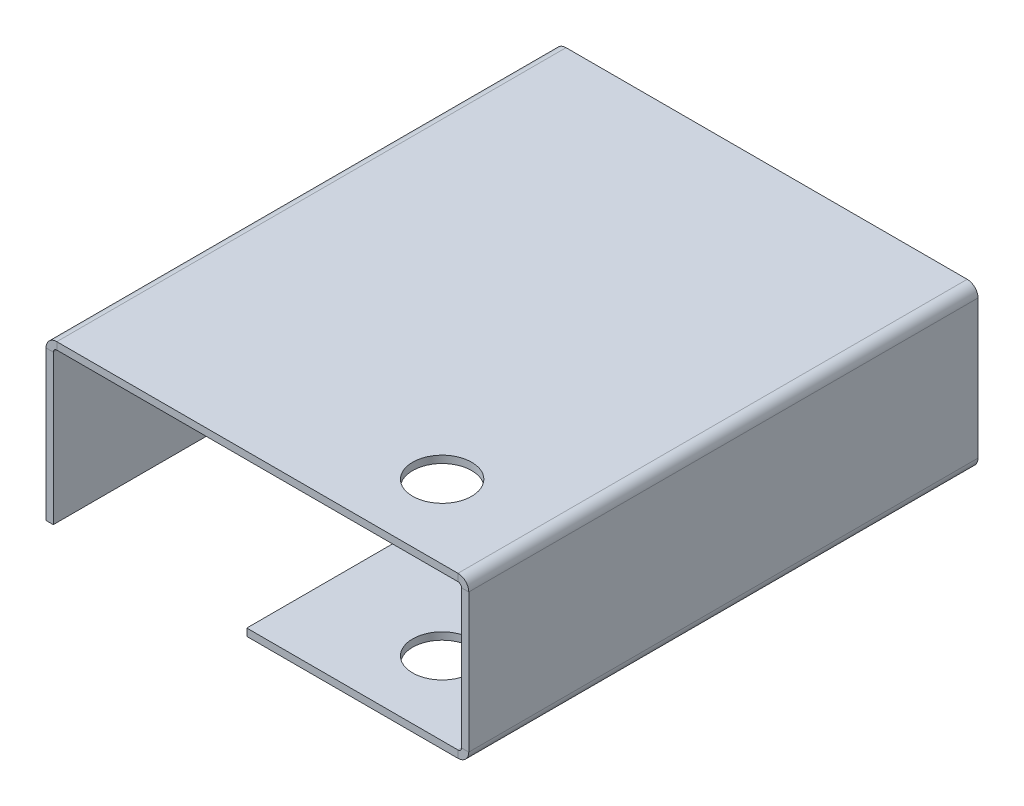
ISO-10303-21;
HEADER;
FILE_DESCRIPTION(('STEP AP214'),'2;1');
FILE_NAME('part.step','',(''),(''),'','','');
FILE_SCHEMA(('AUTOMOTIVE_DESIGN { 1 0 10303 214 1 1 1 1 }'));
ENDSEC;
DATA;
#1=APPLICATION_CONTEXT('core data for automotive mechanical design processes');
#2=APPLICATION_PROTOCOL_DEFINITION('international standard','automotive_design',2000,#1);
#3=PRODUCT_CONTEXT('',#1,'mechanical');
#4=PRODUCT('Part','Part','',(#3));
#5=PRODUCT_RELATED_PRODUCT_CATEGORY('part','',(#4));
#6=PRODUCT_DEFINITION_FORMATION('','',#4);
#7=PRODUCT_DEFINITION_CONTEXT('part definition',#1,'design');
#8=PRODUCT_DEFINITION('design','',#6,#7);
#9=PRODUCT_DEFINITION_SHAPE('','',#8);
#10=(LENGTH_UNIT() NAMED_UNIT(*) SI_UNIT(.MILLI.,.METRE.));
#11=(NAMED_UNIT(*) PLANE_ANGLE_UNIT() SI_UNIT($,.RADIAN.));
#12=(NAMED_UNIT(*) SI_UNIT($,.STERADIAN.) SOLID_ANGLE_UNIT());
#13=UNCERTAINTY_MEASURE_WITH_UNIT(LENGTH_MEASURE(1.E-05),#10,'distance_accuracy_value','');
#14=(GEOMETRIC_REPRESENTATION_CONTEXT(3) GLOBAL_UNCERTAINTY_ASSIGNED_CONTEXT((#13)) GLOBAL_UNIT_ASSIGNED_CONTEXT((#10,
#11,#12)) REPRESENTATION_CONTEXT('',''));
#15=CARTESIAN_POINT('',(0.,0.,0.));
#16=DIRECTION('',(0.,0.,1.));
#17=DIRECTION('',(1.,0.,0.));
#18=AXIS2_PLACEMENT_3D('',#15,#16,#17);
#19=CARTESIAN_POINT('',(-16.5539812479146,33.5756145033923,106.68));
#20=DIRECTION('',(0.,0.,1.));
#21=DIRECTION('',(1.,0.,0.));
#22=AXIS2_PLACEMENT_3D('',#19,#20,#21);
#23=PLANE('',#22);
#24=DIRECTION('',(0.,-1.,0.));
#25=VECTOR('',#24,1.);
#26=CARTESIAN_POINT('',(-16.5539812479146,33.5756145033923,106.68));
#27=LINE('',#26,#25);
#28=CARTESIAN_POINT('',(-16.5539812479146,33.5756145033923,106.68));
#29=VERTEX_POINT('',#28);
#30=CARTESIAN_POINT('',(-16.5539812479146,32.0516145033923,106.68));
#31=VERTEX_POINT('',#30);
#32=EDGE_CURVE('E11',#29,#31,#27,.T.);
#33=ORIENTED_EDGE('',*,*,#32,.F.);
#34=CARTESIAN_POINT('',(-16.5539812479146,31.3150145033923,106.68));
#35=DIRECTION('',(0.,0.,1.));
#36=DIRECTION('',(1.,0.,0.));
#37=AXIS2_PLACEMENT_3D('',#34,#35,#36);
#38=CIRCLE('',#37,2.2606);
#39=CARTESIAN_POINT('',(-18.8145812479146,31.3150145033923,106.68));
#40=VERTEX_POINT('',#39);
#41=EDGE_CURVE('E242',#40,#29,#38,.F.);
#42=ORIENTED_EDGE('',*,*,#41,.F.);
#43=DIRECTION('',(-1.,0.,0.));
#44=VECTOR('',#43,1.);
#45=CARTESIAN_POINT('',(-17.2905812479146,31.3150145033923,106.68));
#46=LINE('',#45,#44);
#47=CARTESIAN_POINT('',(-17.2905812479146,31.3150145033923,106.68));
#48=VERTEX_POINT('',#47);
#49=EDGE_CURVE('E51',#48,#40,#46,.T.);
#50=ORIENTED_EDGE('',*,*,#49,.F.);
#51=CARTESIAN_POINT('',(-16.5539812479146,31.3150145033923,106.68));
#52=DIRECTION('',(0.,0.,1.));
#53=DIRECTION('',(1.,0.,0.));
#54=AXIS2_PLACEMENT_3D('',#51,#52,#53);
#55=CIRCLE('',#54,0.7366);
#56=EDGE_CURVE('E254',#48,#31,#55,.F.);
#57=ORIENTED_EDGE('',*,*,#56,.T.);
#58=EDGE_LOOP('',(#33,#42,#50,#57));
#59=FACE_BOUND('',#58,.T.);
#60=ADVANCED_FACE('F43',(#59),#23,.T.);
#61=CARTESIAN_POINT('',(-17.2905812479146,31.3150145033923,106.68));
#62=DIRECTION('',(0.,0.,1.));
#63=DIRECTION('',(1.,0.,0.));
#64=AXIS2_PLACEMENT_3D('',#61,#62,#63);
#65=PLANE('',#64);
#66=DIRECTION('',(1.,0.,0.));
#67=VECTOR('',#66,1.);
#68=CARTESIAN_POINT('',(-18.8145812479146,33.5756145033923,106.68));
#69=LINE('',#68,#67);
#70=CARTESIAN_POINT('',(67.4910182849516,33.5756145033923,106.68));
#71=VERTEX_POINT('',#70);
#72=EDGE_CURVE('E239',#29,#71,#69,.T.);
#73=ORIENTED_EDGE('',*,*,#72,.F.);
#74=ORIENTED_EDGE('',*,*,#32,.T.);
#75=DIRECTION('',(1.,0.,0.));
#76=VECTOR('',#75,1.);
#77=CARTESIAN_POINT('',(-18.8145812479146,32.0516145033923,106.68));
#78=LINE('',#77,#76);
#79=CARTESIAN_POINT('',(67.4910182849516,32.0516145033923,106.68));
#80=VERTEX_POINT('',#79);
#81=EDGE_CURVE('E257',#31,#80,#78,.T.);
#82=ORIENTED_EDGE('',*,*,#81,.T.);
#83=DIRECTION('',(0.,1.,0.));
#84=VECTOR('',#83,1.);
#85=CARTESIAN_POINT('',(67.4910182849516,32.0516145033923,106.68));
#86=LINE('',#85,#84);
#87=EDGE_CURVE('E315',#80,#71,#86,.T.);
#88=ORIENTED_EDGE('',*,*,#87,.T.);
#89=EDGE_LOOP('',(#73,#74,#82,#88));
#90=FACE_BOUND('',#89,.T.);
#91=ADVANCED_FACE('F358',(#90),#65,.T.);
#92=CARTESIAN_POINT('',(-18.8145812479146,31.3150145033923,0.));
#93=DIRECTION('',(0.,0.,-1.));
#94=DIRECTION('',(-1.,0.,0.));
#95=AXIS2_PLACEMENT_3D('',#92,#93,#94);
#96=PLANE('',#95);
#97=DIRECTION('',(1.,0.,0.));
#98=VECTOR('',#97,1.);
#99=CARTESIAN_POINT('',(-18.8145812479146,31.3150145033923,0.));
#100=LINE('',#99,#98);
#101=CARTESIAN_POINT('',(-18.8145812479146,31.3150145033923,0.));
#102=VERTEX_POINT('',#101);
#103=CARTESIAN_POINT('',(-17.2905812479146,31.3150145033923,0.));
#104=VERTEX_POINT('',#103);
#105=EDGE_CURVE('E321',#102,#104,#100,.T.);
#106=ORIENTED_EDGE('',*,*,#105,.F.);
#107=CARTESIAN_POINT('',(-16.5539812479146,31.3150145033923,0.));
#108=DIRECTION('',(0.,0.,1.));
#109=DIRECTION('',(1.,0.,0.));
#110=AXIS2_PLACEMENT_3D('',#107,#108,#109);
#111=CIRCLE('',#110,2.2606);
#112=CARTESIAN_POINT('',(-16.5539812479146,33.5756145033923,0.));
#113=VERTEX_POINT('',#112);
#114=EDGE_CURVE('E197',#102,#113,#111,.F.);
#115=ORIENTED_EDGE('',*,*,#114,.T.);
#116=DIRECTION('',(0.,1.,0.));
#117=VECTOR('',#116,1.);
#118=CARTESIAN_POINT('',(-16.5539812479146,32.0516145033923,0.));
#119=LINE('',#118,#117);
#120=CARTESIAN_POINT('',(-16.5539812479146,32.0516145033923,0.));
#121=VERTEX_POINT('',#120);
#122=EDGE_CURVE('E319',#121,#113,#119,.T.);
#123=ORIENTED_EDGE('',*,*,#122,.F.);
#124=CARTESIAN_POINT('',(-16.5539812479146,31.3150145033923,0.));
#125=DIRECTION('',(0.,0.,1.));
#126=DIRECTION('',(1.,0.,0.));
#127=AXIS2_PLACEMENT_3D('',#124,#125,#126);
#128=CIRCLE('',#127,0.7366);
#129=EDGE_CURVE('E209',#104,#121,#128,.F.);
#130=ORIENTED_EDGE('',*,*,#129,.F.);
#131=EDGE_LOOP('',(#106,#115,#123,#130));
#132=FACE_BOUND('',#131,.T.);
#133=ADVANCED_FACE('F366',(#132),#96,.T.);
#134=CARTESIAN_POINT('',(-16.5539812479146,32.0516145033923,0.));
#135=DIRECTION('',(0.,0.,-1.));
#136=DIRECTION('',(-1.,0.,0.));
#137=AXIS2_PLACEMENT_3D('',#134,#135,#136);
#138=PLANE('',#137);
#139=DIRECTION('',(0.,1.,0.));
#140=VECTOR('',#139,1.);
#141=CARTESIAN_POINT('',(-18.8145812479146,0.,0.));
#142=LINE('',#141,#140);
#143=CARTESIAN_POINT('',(-18.8145812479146,0.,0.));
#144=VERTEX_POINT('',#143);
#145=EDGE_CURVE('E200',#144,#102,#142,.T.);
#146=ORIENTED_EDGE('',*,*,#145,.T.);
#147=ORIENTED_EDGE('',*,*,#105,.T.);
#148=DIRECTION('',(0.,1.,0.));
#149=VECTOR('',#148,1.);
#150=CARTESIAN_POINT('',(-17.2905812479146,0.,0.));
#151=LINE('',#150,#149);
#152=CARTESIAN_POINT('',(-17.2905812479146,0.,0.));
#153=VERTEX_POINT('',#152);
#154=EDGE_CURVE('E206',#153,#104,#151,.T.);
#155=ORIENTED_EDGE('',*,*,#154,.F.);
#156=DIRECTION('',(-1.,0.,0.));
#157=VECTOR('',#156,1.);
#158=CARTESIAN_POINT('',(-17.2905812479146,0.,0.));
#159=LINE('',#158,#157);
#160=EDGE_CURVE('E203',#153,#144,#159,.T.);
#161=ORIENTED_EDGE('',*,*,#160,.T.);
#162=EDGE_LOOP('',(#146,#147,#155,#161));
#163=FACE_BOUND('',#162,.T.);
#164=ADVANCED_FACE('F368',(#163),#138,.T.);
#165=CARTESIAN_POINT('',(69.7516182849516,31.3150145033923,106.68));
#166=DIRECTION('',(0.,0.,1.));
#167=DIRECTION('',(1.,0.,0.));
#168=AXIS2_PLACEMENT_3D('',#165,#166,#167);
#169=PLANE('',#168);
#170=DIRECTION('',(-1.,0.,0.));
#171=VECTOR('',#170,1.);
#172=CARTESIAN_POINT('',(69.7516182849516,31.3150145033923,106.68));
#173=LINE('',#172,#171);
#174=CARTESIAN_POINT('',(69.7516182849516,31.3150145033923,106.68));
#175=VERTEX_POINT('',#174);
#176=CARTESIAN_POINT('',(68.2276182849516,31.3150145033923,106.68));
#177=VERTEX_POINT('',#176);
#178=EDGE_CURVE('E317',#175,#177,#173,.T.);
#179=ORIENTED_EDGE('',*,*,#178,.F.);
#180=CARTESIAN_POINT('',(67.4910182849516,31.3150145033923,106.68));
#181=DIRECTION('',(0.,0.,1.));
#182=DIRECTION('',(1.,0.,0.));
#183=AXIS2_PLACEMENT_3D('',#180,#181,#182);
#184=CIRCLE('',#183,2.2606);
#185=EDGE_CURVE('E236',#71,#175,#184,.F.);
#186=ORIENTED_EDGE('',*,*,#185,.F.);
#187=ORIENTED_EDGE('',*,*,#87,.F.);
#188=CARTESIAN_POINT('',(67.4910182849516,31.3150145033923,106.68));
#189=DIRECTION('',(0.,0.,1.));
#190=DIRECTION('',(1.,0.,0.));
#191=AXIS2_PLACEMENT_3D('',#188,#189,#190);
#192=CIRCLE('',#191,0.7366);
#193=EDGE_CURVE('E260',#80,#177,#192,.F.);
#194=ORIENTED_EDGE('',*,*,#193,.T.);
#195=EDGE_LOOP('',(#179,#186,#187,#194));
#196=FACE_BOUND('',#195,.T.);
#197=ADVANCED_FACE('F370',(#196),#169,.T.);
#198=CARTESIAN_POINT('',(67.4910182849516,32.0516145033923,106.68));
#199=DIRECTION('',(0.,0.,1.));
#200=DIRECTION('',(1.,0.,0.));
#201=AXIS2_PLACEMENT_3D('',#198,#199,#200);
#202=PLANE('',#201);
#203=DIRECTION('',(0.,-1.,0.));
#204=VECTOR('',#203,1.);
#205=CARTESIAN_POINT('',(69.7516182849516,33.5756145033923,106.68));
#206=LINE('',#205,#204);
#207=CARTESIAN_POINT('',(69.7516182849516,2.2606,106.68));
#208=VERTEX_POINT('',#207);
#209=EDGE_CURVE('E233',#175,#208,#206,.T.);
#210=ORIENTED_EDGE('',*,*,#209,.F.);
#211=ORIENTED_EDGE('',*,*,#178,.T.);
#212=DIRECTION('',(0.,1.,0.));
#213=VECTOR('',#212,1.);
#214=CARTESIAN_POINT('',(68.2276182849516,33.5756145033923,106.68));
#215=LINE('',#214,#213);
#216=CARTESIAN_POINT('',(68.2276182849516,2.2606,106.68));
#217=VERTEX_POINT('',#216);
#218=EDGE_CURVE('E263',#177,#217,#215,.F.);
#219=ORIENTED_EDGE('',*,*,#218,.T.);
#220=DIRECTION('',(1.,0.,0.));
#221=VECTOR('',#220,1.);
#222=CARTESIAN_POINT('',(68.2276182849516,2.2606,106.68));
#223=LINE('',#222,#221);
#224=EDGE_CURVE('E65',#217,#208,#223,.T.);
#225=ORIENTED_EDGE('',*,*,#224,.T.);
#226=EDGE_LOOP('',(#210,#211,#219,#225));
#227=FACE_BOUND('',#226,.T.);
#228=ADVANCED_FACE('F376',(#227),#202,.T.);
#229=CARTESIAN_POINT('',(67.4910182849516,33.5756145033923,0.));
#230=DIRECTION('',(0.,0.,-1.));
#231=DIRECTION('',(-1.,0.,0.));
#232=AXIS2_PLACEMENT_3D('',#229,#230,#231);
#233=PLANE('',#232);
#234=DIRECTION('',(0.,-1.,0.));
#235=VECTOR('',#234,1.);
#236=CARTESIAN_POINT('',(67.4910182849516,33.5756145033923,0.));
#237=LINE('',#236,#235);
#238=CARTESIAN_POINT('',(67.4910182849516,33.5756145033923,0.));
#239=VERTEX_POINT('',#238);
#240=CARTESIAN_POINT('',(67.4910182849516,32.0516145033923,0.));
#241=VERTEX_POINT('',#240);
#242=EDGE_CURVE('E313',#239,#241,#237,.T.);
#243=ORIENTED_EDGE('',*,*,#242,.F.);
#244=CARTESIAN_POINT('',(67.4910182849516,31.3150145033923,0.));
#245=DIRECTION('',(0.,0.,1.));
#246=DIRECTION('',(1.,0.,0.));
#247=AXIS2_PLACEMENT_3D('',#244,#245,#246);
#248=CIRCLE('',#247,2.2606);
#249=CARTESIAN_POINT('',(69.7516182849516,31.3150145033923,0.));
#250=VERTEX_POINT('',#249);
#251=EDGE_CURVE('E191',#239,#250,#248,.F.);
#252=ORIENTED_EDGE('',*,*,#251,.T.);
#253=DIRECTION('',(1.,0.,0.));
#254=VECTOR('',#253,1.);
#255=CARTESIAN_POINT('',(68.2276182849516,31.3150145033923,0.));
#256=LINE('',#255,#254);
#257=CARTESIAN_POINT('',(68.2276182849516,31.3150145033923,0.));
#258=VERTEX_POINT('',#257);
#259=EDGE_CURVE('E311',#258,#250,#256,.T.);
#260=ORIENTED_EDGE('',*,*,#259,.F.);
#261=CARTESIAN_POINT('',(67.4910182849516,31.3150145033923,0.));
#262=DIRECTION('',(0.,0.,1.));
#263=DIRECTION('',(1.,0.,0.));
#264=AXIS2_PLACEMENT_3D('',#261,#262,#263);
#265=CIRCLE('',#264,0.7366);
#266=EDGE_CURVE('E215',#241,#258,#265,.F.);
#267=ORIENTED_EDGE('',*,*,#266,.F.);
#268=EDGE_LOOP('',(#243,#252,#260,#267));
#269=FACE_BOUND('',#268,.T.);
#270=ADVANCED_FACE('F415',(#269),#233,.T.);
#271=CARTESIAN_POINT('',(68.2276182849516,31.3150145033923,0.));
#272=DIRECTION('',(0.,0.,-1.));
#273=DIRECTION('',(-1.,0.,0.));
#274=AXIS2_PLACEMENT_3D('',#271,#272,#273);
#275=PLANE('',#274);
#276=DIRECTION('',(1.,0.,0.));
#277=VECTOR('',#276,1.);
#278=CARTESIAN_POINT('',(-18.8145812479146,33.5756145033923,0.));
#279=LINE('',#278,#277);
#280=EDGE_CURVE('E194',#113,#239,#279,.T.);
#281=ORIENTED_EDGE('',*,*,#280,.T.);
#282=ORIENTED_EDGE('',*,*,#242,.T.);
#283=DIRECTION('',(1.,0.,0.));
#284=VECTOR('',#283,1.);
#285=CARTESIAN_POINT('',(-18.8145812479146,32.0516145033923,0.));
#286=LINE('',#285,#284);
#287=EDGE_CURVE('E212',#121,#241,#286,.T.);
#288=ORIENTED_EDGE('',*,*,#287,.F.);
#289=ORIENTED_EDGE('',*,*,#122,.T.);
#290=EDGE_LOOP('',(#281,#282,#288,#289));
#291=FACE_BOUND('',#290,.T.);
#292=ADVANCED_FACE('F425',(#291),#275,.T.);
#293=CARTESIAN_POINT('',(67.4910182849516,0.,106.68));
#294=DIRECTION('',(0.,0.,1.));
#295=DIRECTION('',(1.,0.,0.));
#296=AXIS2_PLACEMENT_3D('',#293,#294,#295);
#297=PLANE('',#296);
#298=DIRECTION('',(0.,1.,0.));
#299=VECTOR('',#298,1.);
#300=CARTESIAN_POINT('',(67.4910182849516,0.,106.68));
#301=LINE('',#300,#299);
#302=CARTESIAN_POINT('',(67.4910182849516,0.,106.68));
#303=VERTEX_POINT('',#302);
#304=CARTESIAN_POINT('',(67.4910182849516,1.524,106.68));
#305=VERTEX_POINT('',#304);
#306=EDGE_CURVE('E58',#303,#305,#301,.T.);
#307=ORIENTED_EDGE('',*,*,#306,.F.);
#308=CARTESIAN_POINT('',(67.4910182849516,2.2606,106.68));
#309=DIRECTION('',(0.,0.,1.));
#310=DIRECTION('',(1.,0.,0.));
#311=AXIS2_PLACEMENT_3D('',#308,#309,#310);
#312=CIRCLE('',#311,2.2606);
#313=EDGE_CURVE('E230',#208,#303,#312,.F.);
#314=ORIENTED_EDGE('',*,*,#313,.F.);
#315=ORIENTED_EDGE('',*,*,#224,.F.);
#316=CARTESIAN_POINT('',(67.4910182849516,2.2606,106.68));
#317=DIRECTION('',(0.,0.,1.));
#318=DIRECTION('',(1.,0.,0.));
#319=AXIS2_PLACEMENT_3D('',#316,#317,#318);
#320=CIRCLE('',#319,0.7366);
#321=EDGE_CURVE('E265',#217,#305,#320,.F.);
#322=ORIENTED_EDGE('',*,*,#321,.T.);
#323=EDGE_LOOP('',(#307,#314,#315,#322));
#324=FACE_BOUND('',#323,.T.);
#325=ADVANCED_FACE('F435',(#324),#297,.T.);
#326=CARTESIAN_POINT('',(68.2276182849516,2.2606,106.68));
#327=DIRECTION('',(0.,0.,1.));
#328=DIRECTION('',(1.,0.,0.));
#329=AXIS2_PLACEMENT_3D('',#326,#327,#328);
#330=PLANE('',#329);
#331=DIRECTION('',(-1.,0.,0.));
#332=VECTOR('',#331,1.);
#333=CARTESIAN_POINT('',(69.7516182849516,0.,106.68));
#334=LINE('',#333,#332);
#335=CARTESIAN_POINT('',(23.2505394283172,0.,106.68));
#336=VERTEX_POINT('',#335);
#337=EDGE_CURVE('E227',#303,#336,#334,.T.);
#338=ORIENTED_EDGE('',*,*,#337,.F.);
#339=ORIENTED_EDGE('',*,*,#306,.T.);
#340=DIRECTION('',(1.,0.,0.));
#341=VECTOR('',#340,1.);
#342=CARTESIAN_POINT('',(69.7516182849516,1.524,106.68));
#343=LINE('',#342,#341);
#344=CARTESIAN_POINT('',(23.2505394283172,1.524,106.68));
#345=VERTEX_POINT('',#344);
#346=EDGE_CURVE('E224',#305,#345,#343,.F.);
#347=ORIENTED_EDGE('',*,*,#346,.T.);
#348=DIRECTION('',(0.,1.,0.));
#349=VECTOR('',#348,1.);
#350=CARTESIAN_POINT('',(23.2505394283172,0.,106.68));
#351=LINE('',#350,#349);
#352=EDGE_CURVE('E163',#336,#345,#351,.T.);
#353=ORIENTED_EDGE('',*,*,#352,.F.);
#354=EDGE_LOOP('',(#338,#339,#347,#353));
#355=FACE_BOUND('',#354,.T.);
#356=ADVANCED_FACE('F445',(#355),#330,.T.);
#357=CARTESIAN_POINT('',(69.7516182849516,2.2606,0.));
#358=DIRECTION('',(0.,0.,-1.));
#359=DIRECTION('',(-1.,0.,0.));
#360=AXIS2_PLACEMENT_3D('',#357,#358,#359);
#361=PLANE('',#360);
#362=DIRECTION('',(-1.,0.,0.));
#363=VECTOR('',#362,1.);
#364=CARTESIAN_POINT('',(69.7516182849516,2.2606,0.));
#365=LINE('',#364,#363);
#366=CARTESIAN_POINT('',(69.7516182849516,2.2606,0.));
#367=VERTEX_POINT('',#366);
#368=CARTESIAN_POINT('',(68.2276182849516,2.2606,0.));
#369=VERTEX_POINT('',#368);
#370=EDGE_CURVE('E307',#367,#369,#365,.T.);
#371=ORIENTED_EDGE('',*,*,#370,.F.);
#372=CARTESIAN_POINT('',(67.4910182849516,2.2606,0.));
#373=DIRECTION('',(0.,0.,1.));
#374=DIRECTION('',(1.,0.,0.));
#375=AXIS2_PLACEMENT_3D('',#372,#373,#374);
#376=CIRCLE('',#375,2.2606);
#377=CARTESIAN_POINT('',(67.4910182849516,0.,0.));
#378=VERTEX_POINT('',#377);
#379=EDGE_CURVE('E182',#367,#378,#376,.F.);
#380=ORIENTED_EDGE('',*,*,#379,.T.);
#381=DIRECTION('',(0.,-1.,0.));
#382=VECTOR('',#381,1.);
#383=CARTESIAN_POINT('',(67.4910182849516,1.524,0.));
#384=LINE('',#383,#382);
#385=CARTESIAN_POINT('',(67.4910182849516,1.524,0.));
#386=VERTEX_POINT('',#385);
#387=EDGE_CURVE('E166',#386,#378,#384,.T.);
#388=ORIENTED_EDGE('',*,*,#387,.F.);
#389=CARTESIAN_POINT('',(67.4910182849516,2.2606,0.));
#390=DIRECTION('',(0.,0.,1.));
#391=DIRECTION('',(1.,0.,0.));
#392=AXIS2_PLACEMENT_3D('',#389,#390,#391);
#393=CIRCLE('',#392,0.7366);
#394=EDGE_CURVE('E221',#369,#386,#393,.F.);
#395=ORIENTED_EDGE('',*,*,#394,.F.);
#396=EDGE_LOOP('',(#371,#380,#388,#395));
#397=FACE_BOUND('',#396,.T.);
#398=ADVANCED_FACE('F455',(#397),#361,.T.);
#399=CARTESIAN_POINT('',(67.4910182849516,1.524,0.));
#400=DIRECTION('',(0.,0.,-1.));
#401=DIRECTION('',(-1.,0.,0.));
#402=AXIS2_PLACEMENT_3D('',#399,#400,#401);
#403=PLANE('',#402);
#404=DIRECTION('',(0.,-1.,0.));
#405=VECTOR('',#404,1.);
#406=CARTESIAN_POINT('',(69.7516182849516,33.5756145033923,0.));
#407=LINE('',#406,#405);
#408=EDGE_CURVE('E188',#250,#367,#407,.T.);
#409=ORIENTED_EDGE('',*,*,#408,.T.);
#410=ORIENTED_EDGE('',*,*,#370,.T.);
#411=DIRECTION('',(0.,1.,0.));
#412=VECTOR('',#411,1.);
#413=CARTESIAN_POINT('',(68.2276182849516,33.5756145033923,0.));
#414=LINE('',#413,#412);
#415=EDGE_CURVE('E218',#258,#369,#414,.F.);
#416=ORIENTED_EDGE('',*,*,#415,.F.);
#417=ORIENTED_EDGE('',*,*,#259,.T.);
#418=EDGE_LOOP('',(#409,#410,#416,#417));
#419=FACE_BOUND('',#418,.T.);
#420=ADVANCED_FACE('F464',(#419),#403,.T.);
#421=CARTESIAN_POINT('',(69.7516182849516,1.524,106.68));
#422=DIRECTION('',(0.,-1.,0.));
#423=DIRECTION('',(0.,0.,-1.));
#424=AXIS2_PLACEMENT_3D('',#421,#422,#423);
#425=PLANE('',#424);
#426=CARTESIAN_POINT('',(48.7699483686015,1.524,91.2738002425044));
#427=DIRECTION('',(0.,-1.,0.));
#428=DIRECTION('',(0.,0.,-1.));
#429=AXIS2_PLACEMENT_3D('',#426,#427,#428);
#430=CIRCLE('',#429,6.18276165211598);
#431=CARTESIAN_POINT('',(48.7699483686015,1.524,85.0910385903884));
#432=VERTEX_POINT('',#431);
#433=EDGE_CURVE('E176',#432,#432,#430,.T.);
#434=ORIENTED_EDGE('',*,*,#433,.T.);
#435=EDGE_LOOP('',(#434));
#436=FACE_BOUND('',#435,.T.);
#437=DIRECTION('',(1.,0.,0.));
#438=VECTOR('',#437,1.);
#439=CARTESIAN_POINT('',(69.7516182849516,1.524,0.));
#440=LINE('',#439,#438);
#441=CARTESIAN_POINT('',(23.2505394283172,1.524,0.));
#442=VERTEX_POINT('',#441);
#443=EDGE_CURVE('E171',#386,#442,#440,.F.);
#444=ORIENTED_EDGE('',*,*,#443,.T.);
#445=DIRECTION('',(0.,0.,-1.));
#446=VECTOR('',#445,1.);
#447=CARTESIAN_POINT('',(23.2505394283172,1.524,106.68));
#448=LINE('',#447,#446);
#449=EDGE_CURVE('E156',#345,#442,#448,.T.);
#450=ORIENTED_EDGE('',*,*,#449,.F.);
#451=ORIENTED_EDGE('',*,*,#346,.F.);
#452=DIRECTION('',(0.,0.,-1.));
#453=VECTOR('',#452,1.);
#454=CARTESIAN_POINT('',(67.4910182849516,1.524,106.68));
#455=LINE('',#454,#453);
#456=EDGE_CURVE('E174',#305,#386,#455,.T.);
#457=ORIENTED_EDGE('',*,*,#456,.T.);
#458=EDGE_LOOP('',(#444,#450,#451,#457));
#459=FACE_BOUND('',#458,.T.);
#460=ADVANCED_FACE('F172',(#436,#459),#425,.F.);
#461=CARTESIAN_POINT('',(23.2505394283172,0.,106.68));
#462=DIRECTION('',(-1.,0.,0.));
#463=DIRECTION('',(0.,-1.,0.));
#464=AXIS2_PLACEMENT_3D('',#461,#462,#463);
#465=PLANE('',#464);
#466=DIRECTION('',(0.,1.,0.));
#467=VECTOR('',#466,1.);
#468=CARTESIAN_POINT('',(23.2505394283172,0.,0.));
#469=LINE('',#468,#467);
#470=CARTESIAN_POINT('',(23.2505394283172,0.,0.));
#471=VERTEX_POINT('',#470);
#472=EDGE_CURVE('E160',#471,#442,#469,.T.);
#473=ORIENTED_EDGE('',*,*,#472,.F.);
#474=DIRECTION('',(0.,0.,-1.));
#475=VECTOR('',#474,1.);
#476=CARTESIAN_POINT('',(23.2505394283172,0.,106.68));
#477=LINE('',#476,#475);
#478=EDGE_CURVE('E167',#336,#471,#477,.T.);
#479=ORIENTED_EDGE('',*,*,#478,.F.);
#480=ORIENTED_EDGE('',*,*,#352,.T.);
#481=ORIENTED_EDGE('',*,*,#449,.T.);
#482=EDGE_LOOP('',(#473,#479,#480,#481));
#483=FACE_BOUND('',#482,.T.);
#484=ADVANCED_FACE('F158',(#483),#465,.T.);
#485=CARTESIAN_POINT('',(69.7516182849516,0.,106.68));
#486=DIRECTION('',(0.,-1.,0.));
#487=DIRECTION('',(0.,0.,-1.));
#488=AXIS2_PLACEMENT_3D('',#485,#486,#487);
#489=PLANE('',#488);
#490=CARTESIAN_POINT('',(48.7699483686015,0.,91.2738002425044));
#491=DIRECTION('',(0.,1.,0.));
#492=DIRECTION('',(0.,0.,1.));
#493=AXIS2_PLACEMENT_3D('',#490,#491,#492);
#494=CIRCLE('',#493,6.18276165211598);
#495=CARTESIAN_POINT('',(48.7699483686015,0.,97.4565618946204));
#496=VERTEX_POINT('',#495);
#497=EDGE_CURVE('E655',#496,#496,#494,.T.);
#498=ORIENTED_EDGE('',*,*,#497,.T.);
#499=EDGE_LOOP('',(#498));
#500=FACE_BOUND('',#499,.T.);
#501=DIRECTION('',(-1.,0.,0.));
#502=VECTOR('',#501,1.);
#503=CARTESIAN_POINT('',(69.7516182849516,0.,0.));
#504=LINE('',#503,#502);
#505=EDGE_CURVE('E180',#378,#471,#504,.T.);
#506=ORIENTED_EDGE('',*,*,#505,.F.);
#507=DIRECTION('',(0.,0.,-1.));
#508=VECTOR('',#507,1.);
#509=CARTESIAN_POINT('',(67.4910182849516,0.,106.68));
#510=LINE('',#509,#508);
#511=EDGE_CURVE('E302',#303,#378,#510,.T.);
#512=ORIENTED_EDGE('',*,*,#511,.F.);
#513=ORIENTED_EDGE('',*,*,#337,.T.);
#514=ORIENTED_EDGE('',*,*,#478,.T.);
#515=EDGE_LOOP('',(#506,#512,#513,#514));
#516=FACE_BOUND('',#515,.T.);
#517=ADVANCED_FACE('F494',(#500,#516),#489,.T.);
#518=CARTESIAN_POINT('',(67.4910182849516,2.2606,106.68));
#519=DIRECTION('',(0.,0.,-1.));
#520=DIRECTION('',(-1.,0.,0.));
#521=AXIS2_PLACEMENT_3D('',#518,#519,#520);
#522=CYLINDRICAL_SURFACE('',#521,2.2606);
#523=ORIENTED_EDGE('',*,*,#379,.F.);
#524=DIRECTION('',(0.,0.,-1.));
#525=VECTOR('',#524,1.);
#526=CARTESIAN_POINT('',(69.7516182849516,2.2606,106.68));
#527=LINE('',#526,#525);
#528=EDGE_CURVE('E299',#208,#367,#527,.T.);
#529=ORIENTED_EDGE('',*,*,#528,.F.);
#530=ORIENTED_EDGE('',*,*,#313,.T.);
#531=ORIENTED_EDGE('',*,*,#511,.T.);
#532=EDGE_LOOP('',(#523,#529,#530,#531));
#533=FACE_BOUND('',#532,.T.);
#534=ADVANCED_FACE('F503',(#533),#522,.T.);
#535=CARTESIAN_POINT('',(69.7516182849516,33.5756145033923,106.68));
#536=DIRECTION('',(1.,0.,0.));
#537=DIRECTION('',(0.,0.,-1.));
#538=AXIS2_PLACEMENT_3D('',#535,#536,#537);
#539=PLANE('',#538);
#540=ORIENTED_EDGE('',*,*,#408,.F.);
#541=DIRECTION('',(0.,0.,-1.));
#542=VECTOR('',#541,1.);
#543=CARTESIAN_POINT('',(69.7516182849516,31.3150145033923,106.68));
#544=LINE('',#543,#542);
#545=EDGE_CURVE('E296',#175,#250,#544,.T.);
#546=ORIENTED_EDGE('',*,*,#545,.F.);
#547=ORIENTED_EDGE('',*,*,#209,.T.);
#548=ORIENTED_EDGE('',*,*,#528,.T.);
#549=EDGE_LOOP('',(#540,#546,#547,#548));
#550=FACE_BOUND('',#549,.T.);
#551=ADVANCED_FACE('F514',(#550),#539,.T.);
#552=CARTESIAN_POINT('',(67.4910182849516,31.3150145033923,106.68));
#553=DIRECTION('',(0.,0.,-1.));
#554=DIRECTION('',(-1.,0.,0.));
#555=AXIS2_PLACEMENT_3D('',#552,#553,#554);
#556=CYLINDRICAL_SURFACE('',#555,2.2606);
#557=ORIENTED_EDGE('',*,*,#251,.F.);
#558=DIRECTION('',(0.,0.,-1.));
#559=VECTOR('',#558,1.);
#560=CARTESIAN_POINT('',(67.4910182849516,33.5756145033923,106.68));
#561=LINE('',#560,#559);
#562=EDGE_CURVE('E293',#71,#239,#561,.T.);
#563=ORIENTED_EDGE('',*,*,#562,.F.);
#564=ORIENTED_EDGE('',*,*,#185,.T.);
#565=ORIENTED_EDGE('',*,*,#545,.T.);
#566=EDGE_LOOP('',(#557,#563,#564,#565));
#567=FACE_BOUND('',#566,.T.);
#568=ADVANCED_FACE('F524',(#567),#556,.T.);
#569=CARTESIAN_POINT('',(-18.8145812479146,33.5756145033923,106.68));
#570=DIRECTION('',(0.,1.,0.));
#571=DIRECTION('',(0.,0.,1.));
#572=AXIS2_PLACEMENT_3D('',#569,#570,#571);
#573=PLANE('',#572);
#574=CARTESIAN_POINT('',(48.7699483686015,33.5756145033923,91.2738002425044));
#575=DIRECTION('',(0.,1.,0.));
#576=DIRECTION('',(0.,0.,1.));
#577=AXIS2_PLACEMENT_3D('',#574,#575,#576);
#578=CIRCLE('',#577,6.18276165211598);
#579=CARTESIAN_POINT('',(48.7699483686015,33.5756145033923,97.4565618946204));
#580=VERTEX_POINT('',#579);
#581=EDGE_CURVE('E661',#580,#580,#578,.T.);
#582=ORIENTED_EDGE('',*,*,#581,.F.);
#583=EDGE_LOOP('',(#582));
#584=FACE_BOUND('',#583,.T.);
#585=ORIENTED_EDGE('',*,*,#280,.F.);
#586=DIRECTION('',(0.,0.,-1.));
#587=VECTOR('',#586,1.);
#588=CARTESIAN_POINT('',(-16.5539812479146,33.5756145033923,106.68));
#589=LINE('',#588,#587);
#590=EDGE_CURVE('E290',#29,#113,#589,.T.);
#591=ORIENTED_EDGE('',*,*,#590,.F.);
#592=ORIENTED_EDGE('',*,*,#72,.T.);
#593=ORIENTED_EDGE('',*,*,#562,.T.);
#594=EDGE_LOOP('',(#585,#591,#592,#593));
#595=FACE_BOUND('',#594,.T.);
#596=ADVANCED_FACE('F362',(#584,#595),#573,.T.);
#597=CARTESIAN_POINT('',(-16.5539812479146,31.3150145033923,106.68));
#598=DIRECTION('',(0.,0.,-1.));
#599=DIRECTION('',(-1.,0.,0.));
#600=AXIS2_PLACEMENT_3D('',#597,#598,#599);
#601=CYLINDRICAL_SURFACE('',#600,2.2606);
#602=ORIENTED_EDGE('',*,*,#114,.F.);
#603=DIRECTION('',(0.,0.,-1.));
#604=VECTOR('',#603,1.);
#605=CARTESIAN_POINT('',(-18.8145812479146,31.3150145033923,106.68));
#606=LINE('',#605,#604);
#607=EDGE_CURVE('E287',#40,#102,#606,.T.);
#608=ORIENTED_EDGE('',*,*,#607,.F.);
#609=ORIENTED_EDGE('',*,*,#41,.T.);
#610=ORIENTED_EDGE('',*,*,#590,.T.);
#611=EDGE_LOOP('',(#602,#608,#609,#610));
#612=FACE_BOUND('',#611,.T.);
#613=ADVANCED_FACE('F334',(#612),#601,.T.);
#614=CARTESIAN_POINT('',(-18.8145812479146,0.,106.68));
#615=DIRECTION('',(-1.,0.,0.));
#616=DIRECTION('',(0.,0.,1.));
#617=AXIS2_PLACEMENT_3D('',#614,#615,#616);
#618=PLANE('',#617);
#619=ORIENTED_EDGE('',*,*,#145,.F.);
#620=DIRECTION('',(0.,0.,-1.));
#621=VECTOR('',#620,1.);
#622=CARTESIAN_POINT('',(-18.8145812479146,0.,106.68));
#623=LINE('',#622,#621);
#624=CARTESIAN_POINT('',(-18.8145812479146,0.,106.68));
#625=VERTEX_POINT('',#624);
#626=EDGE_CURVE('E285',#625,#144,#623,.T.);
#627=ORIENTED_EDGE('',*,*,#626,.F.);
#628=DIRECTION('',(0.,1.,0.));
#629=VECTOR('',#628,1.);
#630=CARTESIAN_POINT('',(-18.8145812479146,0.,106.68));
#631=LINE('',#630,#629);
#632=EDGE_CURVE('E245',#625,#40,#631,.T.);
#633=ORIENTED_EDGE('',*,*,#632,.T.);
#634=ORIENTED_EDGE('',*,*,#607,.T.);
#635=EDGE_LOOP('',(#619,#627,#633,#634));
#636=FACE_BOUND('',#635,.T.);
#637=ADVANCED_FACE('F338',(#636),#618,.T.);
#638=CARTESIAN_POINT('',(-17.2905812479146,0.,106.68));
#639=DIRECTION('',(0.,-1.,0.));
#640=DIRECTION('',(0.,0.,-1.));
#641=AXIS2_PLACEMENT_3D('',#638,#639,#640);
#642=PLANE('',#641);
#643=ORIENTED_EDGE('',*,*,#160,.F.);
#644=DIRECTION('',(0.,0.,-1.));
#645=VECTOR('',#644,1.);
#646=CARTESIAN_POINT('',(-17.2905812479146,0.,106.68));
#647=LINE('',#646,#645);
#648=CARTESIAN_POINT('',(-17.2905812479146,0.,106.68));
#649=VERTEX_POINT('',#648);
#650=EDGE_CURVE('E283',#649,#153,#647,.T.);
#651=ORIENTED_EDGE('',*,*,#650,.F.);
#652=DIRECTION('',(-1.,0.,0.));
#653=VECTOR('',#652,1.);
#654=CARTESIAN_POINT('',(-17.2905812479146,0.,106.68));
#655=LINE('',#654,#653);
#656=EDGE_CURVE('E248',#649,#625,#655,.T.);
#657=ORIENTED_EDGE('',*,*,#656,.T.);
#658=ORIENTED_EDGE('',*,*,#626,.T.);
#659=EDGE_LOOP('',(#643,#651,#657,#658));
#660=FACE_BOUND('',#659,.T.);
#661=ADVANCED_FACE('F341',(#660),#642,.T.);
#662=CARTESIAN_POINT('',(-17.2905812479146,0.,106.68));
#663=DIRECTION('',(-1.,0.,0.));
#664=DIRECTION('',(0.,0.,1.));
#665=AXIS2_PLACEMENT_3D('',#662,#663,#664);
#666=PLANE('',#665);
#667=ORIENTED_EDGE('',*,*,#154,.T.);
#668=DIRECTION('',(0.,0.,-1.));
#669=VECTOR('',#668,1.);
#670=CARTESIAN_POINT('',(-17.2905812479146,31.3150145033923,106.68));
#671=LINE('',#670,#669);
#672=EDGE_CURVE('E280',#48,#104,#671,.T.);
#673=ORIENTED_EDGE('',*,*,#672,.F.);
#674=DIRECTION('',(0.,1.,0.));
#675=VECTOR('',#674,1.);
#676=CARTESIAN_POINT('',(-17.2905812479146,0.,106.68));
#677=LINE('',#676,#675);
#678=EDGE_CURVE('E251',#649,#48,#677,.T.);
#679=ORIENTED_EDGE('',*,*,#678,.F.);
#680=ORIENTED_EDGE('',*,*,#650,.T.);
#681=EDGE_LOOP('',(#667,#673,#679,#680));
#682=FACE_BOUND('',#681,.T.);
#683=ADVANCED_FACE('F344',(#682),#666,.F.);
#684=CARTESIAN_POINT('',(-16.5539812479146,31.3150145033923,106.68));
#685=DIRECTION('',(0.,0.,-1.));
#686=DIRECTION('',(-1.,0.,0.));
#687=AXIS2_PLACEMENT_3D('',#684,#685,#686);
#688=CYLINDRICAL_SURFACE('',#687,0.7366);
#689=ORIENTED_EDGE('',*,*,#129,.T.);
#690=DIRECTION('',(0.,0.,-1.));
#691=VECTOR('',#690,1.);
#692=CARTESIAN_POINT('',(-16.5539812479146,32.0516145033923,106.68));
#693=LINE('',#692,#691);
#694=EDGE_CURVE('E277',#31,#121,#693,.T.);
#695=ORIENTED_EDGE('',*,*,#694,.F.);
#696=ORIENTED_EDGE('',*,*,#56,.F.);
#697=ORIENTED_EDGE('',*,*,#672,.T.);
#698=EDGE_LOOP('',(#689,#695,#696,#697));
#699=FACE_BOUND('',#698,.T.);
#700=ADVANCED_FACE('F349',(#699),#688,.F.);
#701=CARTESIAN_POINT('',(-18.8145812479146,32.0516145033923,106.68));
#702=DIRECTION('',(0.,1.,0.));
#703=DIRECTION('',(0.,0.,1.));
#704=AXIS2_PLACEMENT_3D('',#701,#702,#703);
#705=PLANE('',#704);
#706=CARTESIAN_POINT('',(48.7699483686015,32.0516145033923,91.2738002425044));
#707=DIRECTION('',(0.,1.,0.));
#708=DIRECTION('',(0.,0.,1.));
#709=AXIS2_PLACEMENT_3D('',#706,#707,#708);
#710=CIRCLE('',#709,6.18276165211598);
#711=CARTESIAN_POINT('',(48.7699483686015,32.0516145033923,97.4565618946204));
#712=VERTEX_POINT('',#711);
#713=EDGE_CURVE('E46',#712,#712,#710,.T.);
#714=ORIENTED_EDGE('',*,*,#713,.T.);
#715=EDGE_LOOP('',(#714));
#716=FACE_BOUND('',#715,.T.);
#717=ORIENTED_EDGE('',*,*,#287,.T.);
#718=DIRECTION('',(0.,0.,-1.));
#719=VECTOR('',#718,1.);
#720=CARTESIAN_POINT('',(67.4910182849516,32.0516145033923,106.68));
#721=LINE('',#720,#719);
#722=EDGE_CURVE('E274',#80,#241,#721,.T.);
#723=ORIENTED_EDGE('',*,*,#722,.F.);
#724=ORIENTED_EDGE('',*,*,#81,.F.);
#725=ORIENTED_EDGE('',*,*,#694,.T.);
#726=EDGE_LOOP('',(#717,#723,#724,#725));
#727=FACE_BOUND('',#726,.T.);
#728=ADVANCED_FACE('F354',(#716,#727),#705,.F.);
#729=CARTESIAN_POINT('',(67.4910182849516,31.3150145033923,106.68));
#730=DIRECTION('',(0.,0.,-1.));
#731=DIRECTION('',(-1.,0.,0.));
#732=AXIS2_PLACEMENT_3D('',#729,#730,#731);
#733=CYLINDRICAL_SURFACE('',#732,0.7366);
#734=ORIENTED_EDGE('',*,*,#266,.T.);
#735=DIRECTION('',(0.,0.,-1.));
#736=VECTOR('',#735,1.);
#737=CARTESIAN_POINT('',(68.2276182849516,31.3150145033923,106.68));
#738=LINE('',#737,#736);
#739=EDGE_CURVE('E271',#177,#258,#738,.T.);
#740=ORIENTED_EDGE('',*,*,#739,.F.);
#741=ORIENTED_EDGE('',*,*,#193,.F.);
#742=ORIENTED_EDGE('',*,*,#722,.T.);
#743=EDGE_LOOP('',(#734,#740,#741,#742));
#744=FACE_BOUND('',#743,.T.);
#745=ADVANCED_FACE('F589',(#744),#733,.F.);
#746=CARTESIAN_POINT('',(68.2276182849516,33.5756145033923,106.68));
#747=DIRECTION('',(1.,0.,0.));
#748=DIRECTION('',(0.,0.,-1.));
#749=AXIS2_PLACEMENT_3D('',#746,#747,#748);
#750=PLANE('',#749);
#751=ORIENTED_EDGE('',*,*,#415,.T.);
#752=DIRECTION('',(0.,0.,-1.));
#753=VECTOR('',#752,1.);
#754=CARTESIAN_POINT('',(68.2276182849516,2.2606,106.68));
#755=LINE('',#754,#753);
#756=EDGE_CURVE('E268',#217,#369,#755,.T.);
#757=ORIENTED_EDGE('',*,*,#756,.F.);
#758=ORIENTED_EDGE('',*,*,#218,.F.);
#759=ORIENTED_EDGE('',*,*,#739,.T.);
#760=EDGE_LOOP('',(#751,#757,#758,#759));
#761=FACE_BOUND('',#760,.T.);
#762=ADVANCED_FACE('F599',(#761),#750,.F.);
#763=CARTESIAN_POINT('',(67.4910182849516,2.2606,106.68));
#764=DIRECTION('',(0.,0.,-1.));
#765=DIRECTION('',(-1.,0.,0.));
#766=AXIS2_PLACEMENT_3D('',#763,#764,#765);
#767=CYLINDRICAL_SURFACE('',#766,0.7366);
#768=ORIENTED_EDGE('',*,*,#394,.T.);
#769=ORIENTED_EDGE('',*,*,#456,.F.);
#770=ORIENTED_EDGE('',*,*,#321,.F.);
#771=ORIENTED_EDGE('',*,*,#756,.T.);
#772=EDGE_LOOP('',(#768,#769,#770,#771));
#773=FACE_BOUND('',#772,.T.);
#774=ADVANCED_FACE('F608',(#773),#767,.F.);
#775=CARTESIAN_POINT('',(67.4910182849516,2.2606,106.68));
#776=DIRECTION('',(0.,0.,1.));
#777=DIRECTION('',(1.,0.,0.));
#778=AXIS2_PLACEMENT_3D('',#775,#776,#777);
#779=PLANE('',#778);
#780=ORIENTED_EDGE('',*,*,#678,.T.);
#781=ORIENTED_EDGE('',*,*,#49,.T.);
#782=ORIENTED_EDGE('',*,*,#632,.F.);
#783=ORIENTED_EDGE('',*,*,#656,.F.);
#784=EDGE_LOOP('',(#780,#781,#782,#783));
#785=FACE_BOUND('',#784,.T.);
#786=ADVANCED_FACE('F326',(#785),#779,.T.);
#787=CARTESIAN_POINT('',(67.4910182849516,2.2606,0.));
#788=DIRECTION('',(0.,0.,1.));
#789=DIRECTION('',(1.,0.,0.));
#790=AXIS2_PLACEMENT_3D('',#787,#788,#789);
#791=PLANE('',#790);
#792=ORIENTED_EDGE('',*,*,#443,.F.);
#793=ORIENTED_EDGE('',*,*,#387,.T.);
#794=ORIENTED_EDGE('',*,*,#505,.T.);
#795=ORIENTED_EDGE('',*,*,#472,.T.);
#796=EDGE_LOOP('',(#792,#793,#794,#795));
#797=FACE_BOUND('',#796,.T.);
#798=ADVANCED_FACE('F178',(#797),#791,.F.);
#799=CARTESIAN_POINT('',(48.7699483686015,0.,91.2738002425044));
#800=DIRECTION('',(0.,1.,0.));
#801=DIRECTION('',(0.,0.,1.));
#802=AXIS2_PLACEMENT_3D('',#799,#800,#801);
#803=CYLINDRICAL_SURFACE('',#802,6.18276165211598);
#804=ORIENTED_EDGE('',*,*,#581,.T.);
#805=EDGE_LOOP('',(#804));
#806=FACE_BOUND('',#805,.T.);
#807=ORIENTED_EDGE('',*,*,#713,.F.);
#808=EDGE_LOOP('',(#807));
#809=FACE_BOUND('',#808,.T.);
#810=ADVANCED_FACE('F632',(#806,#809),#803,.F.);
#811=ORIENTED_EDGE('',*,*,#497,.F.);
#812=EDGE_LOOP('',(#811));
#813=FACE_BOUND('',#812,.T.);
#814=ORIENTED_EDGE('',*,*,#433,.F.);
#815=EDGE_LOOP('',(#814));
#816=FACE_BOUND('',#815,.T.);
#817=ADVANCED_FACE('F640',(#813,#816),#803,.F.);
#818=CLOSED_SHELL('',(#60,#91,#133,#164,#197,#228,#270,#292,#325,#356,#398,#420,#460,#484,#517,
#534,#551,#568,#596,#613,#637,#661,#683,#700,#728,#745,#762,#774,#786,#798,#810,#817));
#819=MANIFOLD_SOLID_BREP('B2',#818);
#820=ADVANCED_BREP_SHAPE_REPRESENTATION('',(#18,#819),#14);
#821=SHAPE_DEFINITION_REPRESENTATION(#9,#820);
ENDSEC;
END-ISO-10303-21;
